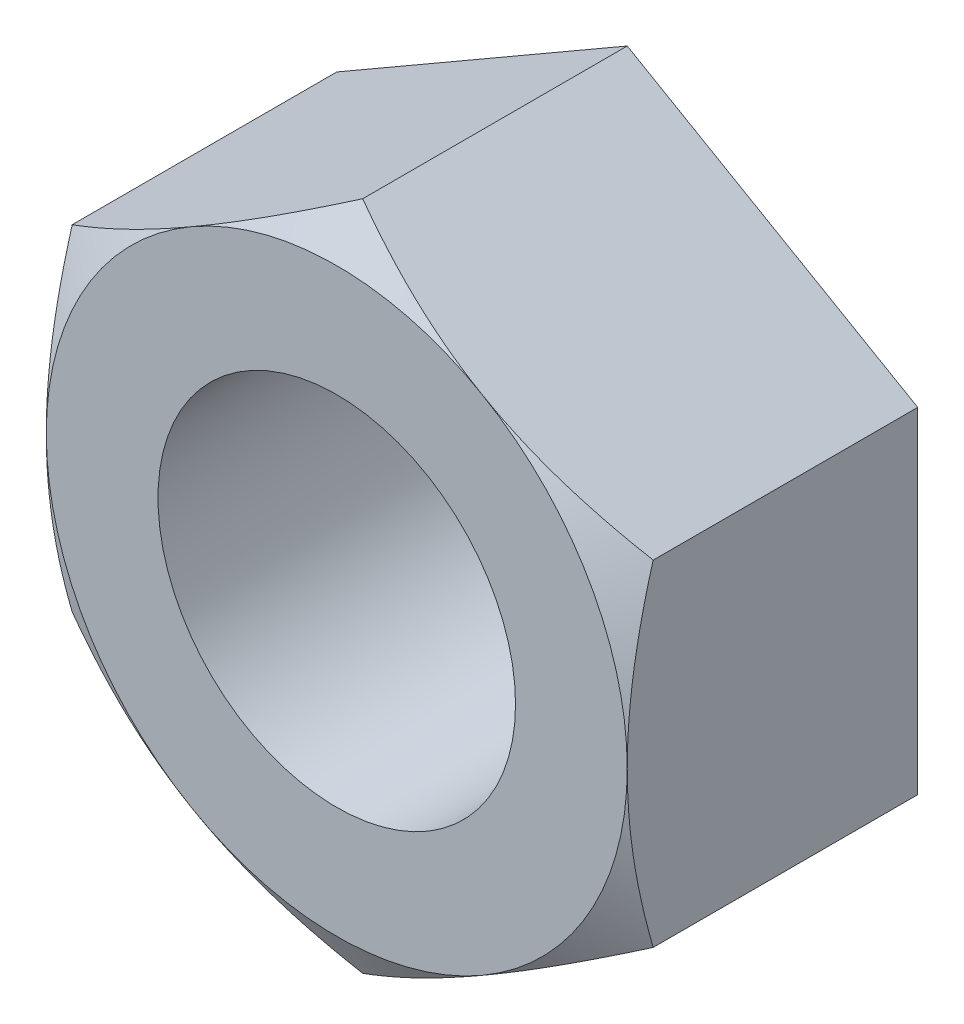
ISO-10303-21;
HEADER;
FILE_DESCRIPTION(('STEP AP214'),'2;1');
FILE_NAME('part.step','',(''),(''),'','','');
FILE_SCHEMA(('AUTOMOTIVE_DESIGN { 1 0 10303 214 1 1 1 1 }'));
ENDSEC;
DATA;
#1=APPLICATION_CONTEXT('core data for automotive mechanical design processes');
#2=APPLICATION_PROTOCOL_DEFINITION('international standard','automotive_design',2000,#1);
#3=PRODUCT_CONTEXT('',#1,'mechanical');
#4=PRODUCT('Part','Part','',(#3));
#5=PRODUCT_RELATED_PRODUCT_CATEGORY('part','',(#4));
#6=PRODUCT_DEFINITION_FORMATION('','',#4);
#7=PRODUCT_DEFINITION_CONTEXT('part definition',#1,'design');
#8=PRODUCT_DEFINITION('design','',#6,#7);
#9=PRODUCT_DEFINITION_SHAPE('','',#8);
#10=(LENGTH_UNIT() NAMED_UNIT(*) SI_UNIT(.MILLI.,.METRE.));
#11=(NAMED_UNIT(*) PLANE_ANGLE_UNIT() SI_UNIT($,.RADIAN.));
#12=(NAMED_UNIT(*) SI_UNIT($,.STERADIAN.) SOLID_ANGLE_UNIT());
#13=UNCERTAINTY_MEASURE_WITH_UNIT(LENGTH_MEASURE(1.E-05),#10,'distance_accuracy_value','');
#14=(GEOMETRIC_REPRESENTATION_CONTEXT(3) GLOBAL_UNCERTAINTY_ASSIGNED_CONTEXT((#13)) GLOBAL_UNIT_ASSIGNED_CONTEXT((#10,
#11,#12)) REPRESENTATION_CONTEXT('',''));
#15=CARTESIAN_POINT('',(0.,0.,0.));
#16=DIRECTION('',(0.,0.,1.));
#17=DIRECTION('',(1.,0.,0.));
#18=AXIS2_PLACEMENT_3D('',#15,#16,#17);
#19=CARTESIAN_POINT('',(-6.5,11.2583302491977,6.5));
#20=DIRECTION('',(0.,0.,1.));
#21=DIRECTION('',(1.,0.,0.));
#22=AXIS2_PLACEMENT_3D('',#19,#20,#21);
#23=PLANE('',#22);
#24=CARTESIAN_POINT('',(0.,0.,6.5));
#25=DIRECTION('',(0.,0.,1.));
#26=DIRECTION('',(1.,0.,0.));
#27=AXIS2_PLACEMENT_3D('',#24,#25,#26);
#28=CIRCLE('',#27,4.00000000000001);
#29=CARTESIAN_POINT('',(4.00000000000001,0.,6.5));
#30=VERTEX_POINT('',#29);
#31=EDGE_CURVE('E407',#30,#30,#28,.T.);
#32=ORIENTED_EDGE('',*,*,#31,.F.);
#33=EDGE_LOOP('',(#32));
#34=FACE_BOUND('',#33,.T.);
#35=CARTESIAN_POINT('',(0.,0.,6.50000000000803));
#36=DIRECTION('',(0.,0.,-1.));
#37=DIRECTION('',(-1.,0.,0.));
#38=AXIS2_PLACEMENT_3D('',#35,#36,#37);
#39=CIRCLE('',#38,6.50000000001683);
#40=CARTESIAN_POINT('',(-3.25000000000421,-5.62916512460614,6.50000000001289));
#41=VERTEX_POINT('',#40);
#42=CARTESIAN_POINT('',(-6.50000000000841,0.,6.50000000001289));
#43=VERTEX_POINT('',#42);
#44=EDGE_CURVE('E74',#41,#43,#39,.T.);
#45=ORIENTED_EDGE('',*,*,#44,.F.);
#46=CARTESIAN_POINT('',(0.,0.,6.50000000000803));
#47=DIRECTION('',(0.,0.,-1.));
#48=DIRECTION('',(-1.,0.,0.));
#49=AXIS2_PLACEMENT_3D('',#46,#47,#48);
#50=CIRCLE('',#49,6.50000000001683);
#51=CARTESIAN_POINT('',(3.25000000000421,-5.62916512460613,6.50000000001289));
#52=VERTEX_POINT('',#51);
#53=EDGE_CURVE('E356',#52,#41,#50,.T.);
#54=ORIENTED_EDGE('',*,*,#53,.F.);
#55=CARTESIAN_POINT('',(0.,0.,6.50000000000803));
#56=DIRECTION('',(0.,0.,-1.));
#57=DIRECTION('',(-1.,0.,0.));
#58=AXIS2_PLACEMENT_3D('',#55,#56,#57);
#59=CIRCLE('',#58,6.50000000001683);
#60=CARTESIAN_POINT('',(6.50000000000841,0.,6.50000000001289));
#61=VERTEX_POINT('',#60);
#62=EDGE_CURVE('E353',#61,#52,#59,.T.);
#63=ORIENTED_EDGE('',*,*,#62,.F.);
#64=CARTESIAN_POINT('',(0.,0.,6.50000000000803));
#65=DIRECTION('',(0.,0.,-1.));
#66=DIRECTION('',(-1.,0.,0.));
#67=AXIS2_PLACEMENT_3D('',#64,#65,#66);
#68=CIRCLE('',#67,6.50000000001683);
#69=CARTESIAN_POINT('',(3.25000000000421,5.62916512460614,6.50000000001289));
#70=VERTEX_POINT('',#69);
#71=EDGE_CURVE('E160',#70,#61,#68,.T.);
#72=ORIENTED_EDGE('',*,*,#71,.F.);
#73=CARTESIAN_POINT('',(0.,0.,6.50000000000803));
#74=DIRECTION('',(0.,0.,-1.));
#75=DIRECTION('',(-1.,0.,0.));
#76=AXIS2_PLACEMENT_3D('',#73,#74,#75);
#77=CIRCLE('',#76,6.50000000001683);
#78=CARTESIAN_POINT('',(-3.25000000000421,5.62916512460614,6.50000000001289));
#79=VERTEX_POINT('',#78);
#80=EDGE_CURVE('E55',#79,#70,#77,.T.);
#81=ORIENTED_EDGE('',*,*,#80,.F.);
#82=CARTESIAN_POINT('',(0.,0.,6.50000000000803));
#83=DIRECTION('',(0.,0.,-1.));
#84=DIRECTION('',(-1.,0.,0.));
#85=AXIS2_PLACEMENT_3D('',#82,#83,#84);
#86=CIRCLE('',#85,6.50000000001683);
#87=EDGE_CURVE('E80',#43,#79,#86,.T.);
#88=ORIENTED_EDGE('',*,*,#87,.F.);
#89=EDGE_LOOP('',(#45,#54,#63,#72,#81,#88));
#90=FACE_BOUND('',#89,.T.);
#91=ADVANCED_FACE('F37',(#34,#90),#23,.T.);
#92=CARTESIAN_POINT('',(0.,0.,5.91596007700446));
#93=DIRECTION('',(0.,0.,-1.));
#94=DIRECTION('',(-1.,0.,0.));
#95=AXIS2_PLACEMENT_3D('',#92,#93,#94);
#96=CONICAL_SURFACE('',#95,7.51158682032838,1.04719755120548);
#97=CARTESIAN_POINT('',(-3.25,5.62916512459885,6.50000000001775));
#98=CARTESIAN_POINT('',(-3.38794426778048,5.54952296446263,6.50002656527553));
#99=CARTESIAN_POINT('',(-3.52588189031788,5.46988464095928,6.49662027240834));
#100=CARTESIAN_POINT('',(-3.80148629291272,5.3107643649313,6.48313941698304));
#101=CARTESIAN_POINT('',(-3.93915312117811,5.2312823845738,6.47306617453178));
#102=CARTESIAN_POINT('',(-4.21332671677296,5.07298818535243,6.44651519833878));
#103=CARTESIAN_POINT('',(-4.34983584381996,4.994174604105,6.43006970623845));
#104=CARTESIAN_POINT('',(-4.62220372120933,4.83692293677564,6.39112797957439));
#105=CARTESIAN_POINT('',(-4.75806245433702,4.7584848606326,6.36863158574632));
#106=CARTESIAN_POINT('',(-5.16409991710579,4.52405902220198,6.2927610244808));
#107=CARTESIAN_POINT('',(-5.43309909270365,4.36875227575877,6.23096863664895));
#108=CARTESIAN_POINT('',(-5.96878416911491,4.05947435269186,6.08845958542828));
#109=CARTESIAN_POINT('',(-6.23545138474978,3.90551396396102,6.00764841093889));
#110=CARTESIAN_POINT('',(-6.50000000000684,3.75277674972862,5.9194434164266));
#111=B_SPLINE_CURVE_WITH_KNOTS('',3,(#97,#98,#99,#100,#101,#102,#103,#104,#105,#106,#107,#108,
#109,#110),.UNSPECIFIED.,.F.,.F.,(4,2,2,2,2,2,4),(0.,0.477804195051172,0.955513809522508,
1.43083727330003,1.90617324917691,2.85559935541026,3.80984701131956),.UNSPECIFIED.);
#112=CARTESIAN_POINT('',(-6.5,3.75277674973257,5.9194434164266));
#113=VERTEX_POINT('',#112);
#114=EDGE_CURVE('E177',#79,#113,#111,.T.);
#115=ORIENTED_EDGE('',*,*,#114,.T.);
#116=CARTESIAN_POINT('',(-6.5,3.75277674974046,5.9194434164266));
#117=CARTESIAN_POINT('',(-6.5,3.44730232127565,6.00764841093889));
#118=CARTESIAN_POINT('',(-6.5,3.13938154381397,6.08845958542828));
#119=CARTESIAN_POINT('',(-6.5,2.52082569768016,6.23096863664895));
#120=CARTESIAN_POINT('',(-6.5,2.21021220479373,6.2927610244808));
#121=CARTESIAN_POINT('',(-6.5,1.74136052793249,6.36863158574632));
#122=CARTESIAN_POINT('',(-6.5,1.58448437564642,6.39112797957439));
#123=CARTESIAN_POINT('',(-6.5,1.2699810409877,6.43006970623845));
#124=CARTESIAN_POINT('',(-6.5,1.11235387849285,6.44651519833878));
#125=CARTESIAN_POINT('',(-6.5,0.795765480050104,6.47306617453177));
#126=CARTESIAN_POINT('',(-6.5,0.636801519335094,6.48313941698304));
#127=CARTESIAN_POINT('',(-6.5,0.31856096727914,6.49662027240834));
#128=CARTESIAN_POINT('',(-6.5,0.15928432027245,6.50002656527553));
#129=CARTESIAN_POINT('',(-6.5,0.,6.50000000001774));
#130=B_SPLINE_CURVE_WITH_KNOTS('',3,(#116,#117,#118,#119,#120,#121,#122,#123,#124,#125,#126,
#127,#128,#129),.UNSPECIFIED.,.F.,.F.,(4,2,2,2,2,2,4),(0.,0.954247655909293,1.90367376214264,
2.37900973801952,2.85433320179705,3.33204281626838,3.80984701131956),.UNSPECIFIED.);
#131=EDGE_CURVE('E305',#113,#43,#130,.T.);
#132=ORIENTED_EDGE('',*,*,#131,.T.);
#133=ORIENTED_EDGE('',*,*,#87,.T.);
#134=EDGE_LOOP('',(#115,#132,#133));
#135=FACE_BOUND('',#134,.T.);
#136=ADVANCED_FACE('F310',(#135),#96,.T.);
#137=CARTESIAN_POINT('',(0.,0.,5.91596007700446));
#138=DIRECTION('',(0.,0.,-1.));
#139=DIRECTION('',(-1.,0.,0.));
#140=AXIS2_PLACEMENT_3D('',#137,#138,#139);
#141=CONICAL_SURFACE('',#140,7.51158682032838,1.04719755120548);
#142=ORIENTED_EDGE('',*,*,#44,.T.);
#143=CARTESIAN_POINT('',(-6.5,0.,6.50000000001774));
#144=CARTESIAN_POINT('',(-6.5,-0.15928432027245,6.50002656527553));
#145=CARTESIAN_POINT('',(-6.5,-0.31856096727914,6.49662027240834));
#146=CARTESIAN_POINT('',(-6.5,-0.636801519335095,6.48313941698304));
#147=CARTESIAN_POINT('',(-6.5,-0.795765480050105,6.47306617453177));
#148=CARTESIAN_POINT('',(-6.5,-1.11235387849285,6.44651519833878));
#149=CARTESIAN_POINT('',(-6.5,-1.2699810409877,6.43006970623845));
#150=CARTESIAN_POINT('',(-6.5,-1.58448437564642,6.39112797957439));
#151=CARTESIAN_POINT('',(-6.5,-1.74136052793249,6.36863158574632));
#152=CARTESIAN_POINT('',(-6.5,-2.21021220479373,6.2927610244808));
#153=CARTESIAN_POINT('',(-6.5,-2.52082569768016,6.23096863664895));
#154=CARTESIAN_POINT('',(-6.5,-3.13938154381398,6.08845958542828));
#155=CARTESIAN_POINT('',(-6.5,-3.44730232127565,6.00764841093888));
#156=CARTESIAN_POINT('',(-6.5,-3.75277674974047,5.9194434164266));
#157=B_SPLINE_CURVE_WITH_KNOTS('',3,(#143,#144,#145,#146,#147,#148,#149,#150,#151,#152,#153,
#154,#155,#156),.UNSPECIFIED.,.F.,.F.,(4,2,2,2,2,2,4),(0.,0.477804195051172,0.955513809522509,
1.43083727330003,1.90617324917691,2.85559935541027,3.80984701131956),.UNSPECIFIED.);
#158=CARTESIAN_POINT('',(-6.5,-3.75277674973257,5.9194434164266));
#159=VERTEX_POINT('',#158);
#160=EDGE_CURVE('E277',#43,#159,#157,.T.);
#161=ORIENTED_EDGE('',*,*,#160,.T.);
#162=CARTESIAN_POINT('',(-6.50000000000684,-3.75277674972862,5.9194434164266));
#163=CARTESIAN_POINT('',(-6.23545138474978,-3.90551396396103,6.00764841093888));
#164=CARTESIAN_POINT('',(-5.96878416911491,-4.05947435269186,6.08845958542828));
#165=CARTESIAN_POINT('',(-5.43309909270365,-4.36875227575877,6.23096863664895));
#166=CARTESIAN_POINT('',(-5.16409991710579,-4.52405902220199,6.2927610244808));
#167=CARTESIAN_POINT('',(-4.75806245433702,-4.75848486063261,6.36863158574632));
#168=CARTESIAN_POINT('',(-4.62220372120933,-4.83692293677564,6.39112797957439));
#169=CARTESIAN_POINT('',(-4.34983584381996,-4.994174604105,6.43006970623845));
#170=CARTESIAN_POINT('',(-4.21332671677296,-5.07298818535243,6.44651519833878));
#171=CARTESIAN_POINT('',(-3.93915312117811,-5.2312823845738,6.47306617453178));
#172=CARTESIAN_POINT('',(-3.80148629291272,-5.3107643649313,6.48313941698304));
#173=CARTESIAN_POINT('',(-3.52588189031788,-5.46988464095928,6.49662027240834));
#174=CARTESIAN_POINT('',(-3.38794426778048,-5.54952296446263,6.50002656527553));
#175=CARTESIAN_POINT('',(-3.25,-5.62916512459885,6.50000000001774));
#176=B_SPLINE_CURVE_WITH_KNOTS('',3,(#162,#163,#164,#165,#166,#167,#168,#169,#170,#171,#172,
#173,#174,#175),.UNSPECIFIED.,.F.,.F.,(4,2,2,2,2,2,4),(0.,0.954247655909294,1.90367376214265,
2.37900973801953,2.85433320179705,3.33204281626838,3.80984701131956),.UNSPECIFIED.);
#177=EDGE_CURVE('E336',#159,#41,#176,.T.);
#178=ORIENTED_EDGE('',*,*,#177,.T.);
#179=EDGE_LOOP('',(#142,#161,#178));
#180=FACE_BOUND('',#179,.T.);
#181=ADVANCED_FACE('F313',(#180),#141,.T.);
#182=CARTESIAN_POINT('',(0.,0.,5.91596007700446));
#183=DIRECTION('',(0.,0.,-1.));
#184=DIRECTION('',(-1.,0.,0.));
#185=AXIS2_PLACEMENT_3D('',#182,#183,#184);
#186=CONICAL_SURFACE('',#185,7.51158682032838,1.04719755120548);
#187=ORIENTED_EDGE('',*,*,#53,.T.);
#188=CARTESIAN_POINT('',(-3.25,-5.62916512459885,6.50000000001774));
#189=CARTESIAN_POINT('',(-3.11205573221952,-5.70880728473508,6.50002656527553));
#190=CARTESIAN_POINT('',(-2.97411810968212,-5.78844560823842,6.49662027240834));
#191=CARTESIAN_POINT('',(-2.69851370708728,-5.9475658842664,6.48313941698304));
#192=CARTESIAN_POINT('',(-2.56084687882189,-6.0270478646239,6.47306617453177));
#193=CARTESIAN_POINT('',(-2.28667328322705,-6.18534206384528,6.44651519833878));
#194=CARTESIAN_POINT('',(-2.15016415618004,-6.2641556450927,6.43006970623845));
#195=CARTESIAN_POINT('',(-1.87779627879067,-6.42140731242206,6.39112797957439));
#196=CARTESIAN_POINT('',(-1.74193754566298,-6.4998453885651,6.36863158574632));
#197=CARTESIAN_POINT('',(-1.33590008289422,-6.73427122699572,6.2927610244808));
#198=CARTESIAN_POINT('',(-1.06690090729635,-6.88957797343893,6.23096863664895));
#199=CARTESIAN_POINT('',(-0.531215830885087,-7.19885589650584,6.08845958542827));
#200=CARTESIAN_POINT('',(-0.264548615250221,-7.35281628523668,6.00764841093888));
#201=CARTESIAN_POINT('',(6.84003077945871E-12,-7.50555349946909,5.9194434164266));
#202=B_SPLINE_CURVE_WITH_KNOTS('',3,(#188,#189,#190,#191,#192,#193,#194,#195,#196,#197,#198,
#199,#200,#201),.UNSPECIFIED.,.F.,.F.,(4,2,2,2,2,2,4),(0.,0.477804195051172,0.955513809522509,
1.43083727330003,1.90617324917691,2.85559935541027,3.80984701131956),.UNSPECIFIED.);
#203=CARTESIAN_POINT('',(0.,-7.50555349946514,5.9194434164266));
#204=VERTEX_POINT('',#203);
#205=EDGE_CURVE('E241',#41,#204,#202,.T.);
#206=ORIENTED_EDGE('',*,*,#205,.T.);
#207=CARTESIAN_POINT('',(-6.84076456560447E-12,-7.50555349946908,5.9194434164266));
#208=CARTESIAN_POINT('',(0.26454861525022,-7.35281628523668,6.00764841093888));
#209=CARTESIAN_POINT('',(0.531215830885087,-7.19885589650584,6.08845958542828));
#210=CARTESIAN_POINT('',(1.06690090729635,-6.88957797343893,6.23096863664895));
#211=CARTESIAN_POINT('',(1.33590008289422,-6.73427122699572,6.2927610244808));
#212=CARTESIAN_POINT('',(1.74193754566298,-6.4998453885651,6.36863158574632));
#213=CARTESIAN_POINT('',(1.87779627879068,-6.42140731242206,6.39112797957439));
#214=CARTESIAN_POINT('',(2.15016415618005,-6.2641556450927,6.43006970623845));
#215=CARTESIAN_POINT('',(2.28667328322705,-6.18534206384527,6.44651519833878));
#216=CARTESIAN_POINT('',(2.56084687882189,-6.0270478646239,6.47306617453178));
#217=CARTESIAN_POINT('',(2.69851370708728,-5.9475658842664,6.48313941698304));
#218=CARTESIAN_POINT('',(2.97411810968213,-5.78844560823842,6.49662027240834));
#219=CARTESIAN_POINT('',(3.11205573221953,-5.70880728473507,6.50002656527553));
#220=CARTESIAN_POINT('',(3.25000000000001,-5.62916512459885,6.50000000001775));
#221=B_SPLINE_CURVE_WITH_KNOTS('',3,(#207,#208,#209,#210,#211,#212,#213,#214,#215,#216,#217,
#218,#219,#220),.UNSPECIFIED.,.F.,.F.,(4,2,2,2,2,2,4),(0.,0.954247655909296,1.90367376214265,
2.37900973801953,2.85433320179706,3.33204281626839,3.80984701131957),.UNSPECIFIED.);
#222=EDGE_CURVE('E276',#204,#52,#221,.T.);
#223=ORIENTED_EDGE('',*,*,#222,.T.);
#224=EDGE_LOOP('',(#187,#206,#223));
#225=FACE_BOUND('',#224,.T.);
#226=ADVANCED_FACE('F248',(#225),#186,.T.);
#227=CARTESIAN_POINT('',(0.,0.,5.91596007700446));
#228=DIRECTION('',(0.,0.,-1.));
#229=DIRECTION('',(-1.,0.,0.));
#230=AXIS2_PLACEMENT_3D('',#227,#228,#229);
#231=CONICAL_SURFACE('',#230,7.51158682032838,1.04719755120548);
#232=ORIENTED_EDGE('',*,*,#62,.T.);
#233=CARTESIAN_POINT('',(3.25,-5.62916512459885,6.50000000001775));
#234=CARTESIAN_POINT('',(3.38794426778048,-5.54952296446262,6.50002656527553));
#235=CARTESIAN_POINT('',(3.52588189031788,-5.46988464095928,6.49662027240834));
#236=CARTESIAN_POINT('',(3.80148629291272,-5.3107643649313,6.48313941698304));
#237=CARTESIAN_POINT('',(3.93915312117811,-5.2312823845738,6.47306617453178));
#238=CARTESIAN_POINT('',(4.21332671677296,-5.07298818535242,6.44651519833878));
#239=CARTESIAN_POINT('',(4.34983584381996,-4.994174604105,6.43006970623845));
#240=CARTESIAN_POINT('',(4.62220372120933,-4.83692293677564,6.39112797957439));
#241=CARTESIAN_POINT('',(4.75806245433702,-4.7584848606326,6.36863158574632));
#242=CARTESIAN_POINT('',(5.16409991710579,-4.52405902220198,6.2927610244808));
#243=CARTESIAN_POINT('',(5.43309909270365,-4.36875227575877,6.23096863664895));
#244=CARTESIAN_POINT('',(5.96878416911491,-4.05947435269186,6.08845958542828));
#245=CARTESIAN_POINT('',(6.23545138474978,-3.90551396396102,6.00764841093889));
#246=CARTESIAN_POINT('',(6.50000000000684,-3.75277674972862,5.9194434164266));
#247=B_SPLINE_CURVE_WITH_KNOTS('',3,(#233,#234,#235,#236,#237,#238,#239,#240,#241,#242,#243,
#244,#245,#246),.UNSPECIFIED.,.F.,.F.,(4,2,2,2,2,2,4),(0.,0.477804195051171,0.955513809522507,
1.43083727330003,1.90617324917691,2.85559935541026,3.80984701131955),.UNSPECIFIED.);
#248=CARTESIAN_POINT('',(6.5,-3.75277674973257,5.9194434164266));
#249=VERTEX_POINT('',#248);
#250=EDGE_CURVE('E226',#52,#249,#247,.T.);
#251=ORIENTED_EDGE('',*,*,#250,.T.);
#252=CARTESIAN_POINT('',(6.5,-3.75277674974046,5.9194434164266));
#253=CARTESIAN_POINT('',(6.5,-3.44730232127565,6.00764841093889));
#254=CARTESIAN_POINT('',(6.5,-3.13938154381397,6.08845958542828));
#255=CARTESIAN_POINT('',(6.5,-2.52082569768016,6.23096863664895));
#256=CARTESIAN_POINT('',(6.5,-2.21021220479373,6.2927610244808));
#257=CARTESIAN_POINT('',(6.5,-1.74136052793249,6.36863158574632));
#258=CARTESIAN_POINT('',(6.5,-1.58448437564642,6.39112797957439));
#259=CARTESIAN_POINT('',(6.5,-1.2699810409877,6.43006970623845));
#260=CARTESIAN_POINT('',(6.5,-1.11235387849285,6.44651519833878));
#261=CARTESIAN_POINT('',(6.5,-0.795765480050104,6.47306617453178));
#262=CARTESIAN_POINT('',(6.5,-0.636801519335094,6.48313941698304));
#263=CARTESIAN_POINT('',(6.5,-0.318560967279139,6.49662027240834));
#264=CARTESIAN_POINT('',(6.5,-0.159284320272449,6.50002656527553));
#265=CARTESIAN_POINT('',(6.5,0.,6.50000000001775));
#266=B_SPLINE_CURVE_WITH_KNOTS('',3,(#252,#253,#254,#255,#256,#257,#258,#259,#260,#261,#262,
#263,#264,#265),.UNSPECIFIED.,.F.,.F.,(4,2,2,2,2,2,4),(0.,0.954247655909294,1.90367376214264,
2.37900973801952,2.85433320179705,3.33204281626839,3.80984701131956),.UNSPECIFIED.);
#267=EDGE_CURVE('E240',#249,#61,#266,.T.);
#268=ORIENTED_EDGE('',*,*,#267,.T.);
#269=EDGE_LOOP('',(#232,#251,#268));
#270=FACE_BOUND('',#269,.T.);
#271=ADVANCED_FACE('F244',(#270),#231,.T.);
#272=CARTESIAN_POINT('',(0.,0.,5.91596007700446));
#273=DIRECTION('',(0.,0.,-1.));
#274=DIRECTION('',(-1.,0.,0.));
#275=AXIS2_PLACEMENT_3D('',#272,#273,#274);
#276=CONICAL_SURFACE('',#275,7.51158682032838,1.04719755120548);
#277=CARTESIAN_POINT('',(6.5,0.,6.50000000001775));
#278=CARTESIAN_POINT('',(6.5,0.159284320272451,6.50002656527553));
#279=CARTESIAN_POINT('',(6.5,0.31856096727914,6.49662027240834));
#280=CARTESIAN_POINT('',(6.5,0.636801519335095,6.48313941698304));
#281=CARTESIAN_POINT('',(6.5,0.795765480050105,6.47306617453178));
#282=CARTESIAN_POINT('',(6.5,1.11235387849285,6.44651519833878));
#283=CARTESIAN_POINT('',(6.5,1.2699810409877,6.43006970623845));
#284=CARTESIAN_POINT('',(6.5,1.58448437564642,6.39112797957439));
#285=CARTESIAN_POINT('',(6.5,1.7413605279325,6.36863158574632));
#286=CARTESIAN_POINT('',(6.5,2.21021220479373,6.2927610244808));
#287=CARTESIAN_POINT('',(6.5,2.52082569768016,6.23096863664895));
#288=CARTESIAN_POINT('',(6.5,3.13938154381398,6.08845958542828));
#289=CARTESIAN_POINT('',(6.5,3.44730232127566,6.00764841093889));
#290=CARTESIAN_POINT('',(6.5,3.75277674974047,5.9194434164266));
#291=B_SPLINE_CURVE_WITH_KNOTS('',3,(#277,#278,#279,#280,#281,#282,#283,#284,#285,#286,#287,
#288,#289,#290),.UNSPECIFIED.,.F.,.F.,(4,2,2,2,2,2,4),(0.,0.477804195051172,0.955513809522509,
1.43083727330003,1.90617324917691,2.85559935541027,3.80984701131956),.UNSPECIFIED.);
#292=CARTESIAN_POINT('',(6.5,3.75277674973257,5.9194434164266));
#293=VERTEX_POINT('',#292);
#294=EDGE_CURVE('E204',#61,#293,#291,.T.);
#295=ORIENTED_EDGE('',*,*,#294,.T.);
#296=CARTESIAN_POINT('',(6.50000000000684,3.75277674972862,5.9194434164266));
#297=CARTESIAN_POINT('',(6.23545138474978,3.90551396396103,6.00764841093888));
#298=CARTESIAN_POINT('',(5.96878416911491,4.05947435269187,6.08845958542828));
#299=CARTESIAN_POINT('',(5.43309909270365,4.36875227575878,6.23096863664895));
#300=CARTESIAN_POINT('',(5.16409991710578,4.52405902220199,6.2927610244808));
#301=CARTESIAN_POINT('',(4.75806245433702,4.75848486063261,6.36863158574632));
#302=CARTESIAN_POINT('',(4.62220372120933,4.83692293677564,6.39112797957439));
#303=CARTESIAN_POINT('',(4.34983584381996,4.994174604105,6.43006970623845));
#304=CARTESIAN_POINT('',(4.21332671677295,5.07298818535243,6.44651519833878));
#305=CARTESIAN_POINT('',(3.93915312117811,5.2312823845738,6.47306617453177));
#306=CARTESIAN_POINT('',(3.80148629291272,5.31076436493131,6.48313941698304));
#307=CARTESIAN_POINT('',(3.52588189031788,5.46988464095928,6.49662027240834));
#308=CARTESIAN_POINT('',(3.38794426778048,5.54952296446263,6.50002656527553));
#309=CARTESIAN_POINT('',(3.25,5.62916512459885,6.50000000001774));
#310=B_SPLINE_CURVE_WITH_KNOTS('',3,(#296,#297,#298,#299,#300,#301,#302,#303,#304,#305,#306,
#307,#308,#309),.UNSPECIFIED.,.F.,.F.,(4,2,2,2,2,2,4),(0.,0.954247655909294,1.90367376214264,
2.37900973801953,2.85433320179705,3.33204281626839,3.80984701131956),.UNSPECIFIED.);
#311=EDGE_CURVE('E47',#293,#70,#310,.T.);
#312=ORIENTED_EDGE('',*,*,#311,.T.);
#313=ORIENTED_EDGE('',*,*,#71,.T.);
#314=EDGE_LOOP('',(#295,#312,#313));
#315=FACE_BOUND('',#314,.T.);
#316=ADVANCED_FACE('F193',(#315),#276,.T.);
#317=CARTESIAN_POINT('',(0.,0.,5.91596007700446));
#318=DIRECTION('',(0.,0.,-1.));
#319=DIRECTION('',(-1.,0.,0.));
#320=AXIS2_PLACEMENT_3D('',#317,#318,#319);
#321=CONICAL_SURFACE('',#320,7.51158682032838,1.04719755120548);
#322=CARTESIAN_POINT('',(3.25,5.62916512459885,6.50000000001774));
#323=CARTESIAN_POINT('',(3.11205573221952,5.70880728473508,6.50002656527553));
#324=CARTESIAN_POINT('',(2.97411810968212,5.78844560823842,6.49662027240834));
#325=CARTESIAN_POINT('',(2.69851370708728,5.9475658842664,6.48313941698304));
#326=CARTESIAN_POINT('',(2.56084687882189,6.02704786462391,6.47306617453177));
#327=CARTESIAN_POINT('',(2.28667328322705,6.18534206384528,6.44651519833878));
#328=CARTESIAN_POINT('',(2.15016415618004,6.26415564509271,6.43006970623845));
#329=CARTESIAN_POINT('',(1.87779627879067,6.42140731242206,6.39112797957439));
#330=CARTESIAN_POINT('',(1.74193754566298,6.4998453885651,6.36863158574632));
#331=CARTESIAN_POINT('',(1.33590008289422,6.73427122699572,6.2927610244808));
#332=CARTESIAN_POINT('',(1.06690090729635,6.88957797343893,6.23096863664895));
#333=CARTESIAN_POINT('',(0.531215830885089,7.19885589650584,6.08845958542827));
#334=CARTESIAN_POINT('',(0.264548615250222,7.35281628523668,6.00764841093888));
#335=CARTESIAN_POINT('',(-6.83914730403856E-12,7.50555349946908,5.9194434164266));
#336=B_SPLINE_CURVE_WITH_KNOTS('',3,(#322,#323,#324,#325,#326,#327,#328,#329,#330,#331,#332,
#333,#334,#335),.UNSPECIFIED.,.F.,.F.,(4,2,2,2,2,2,4),(0.,0.477804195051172,0.955513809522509,
1.43083727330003,1.90617324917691,2.85559935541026,3.80984701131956),.UNSPECIFIED.);
#337=CARTESIAN_POINT('',(0.,7.50555349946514,5.9194434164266));
#338=VERTEX_POINT('',#337);
#339=EDGE_CURVE('E12',#70,#338,#336,.T.);
#340=ORIENTED_EDGE('',*,*,#339,.T.);
#341=CARTESIAN_POINT('',(6.84052348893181E-12,7.50555349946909,5.9194434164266));
#342=CARTESIAN_POINT('',(-0.26454861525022,7.35281628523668,6.00764841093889));
#343=CARTESIAN_POINT('',(-0.531215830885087,7.19885589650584,6.08845958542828));
#344=CARTESIAN_POINT('',(-1.06690090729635,6.88957797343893,6.23096863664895));
#345=CARTESIAN_POINT('',(-1.33590008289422,6.73427122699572,6.2927610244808));
#346=CARTESIAN_POINT('',(-1.74193754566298,6.4998453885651,6.36863158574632));
#347=CARTESIAN_POINT('',(-1.87779627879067,6.42140731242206,6.39112797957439));
#348=CARTESIAN_POINT('',(-2.15016415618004,6.2641556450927,6.43006970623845));
#349=CARTESIAN_POINT('',(-2.28667328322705,6.18534206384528,6.44651519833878));
#350=CARTESIAN_POINT('',(-2.56084687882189,6.0270478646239,6.47306617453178));
#351=CARTESIAN_POINT('',(-2.69851370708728,5.9475658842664,6.48313941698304));
#352=CARTESIAN_POINT('',(-2.97411810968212,5.78844560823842,6.49662027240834));
#353=CARTESIAN_POINT('',(-3.11205573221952,5.70880728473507,6.50002656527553));
#354=CARTESIAN_POINT('',(-3.25,5.62916512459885,6.50000000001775));
#355=B_SPLINE_CURVE_WITH_KNOTS('',3,(#341,#342,#343,#344,#345,#346,#347,#348,#349,#350,#351,
#352,#353,#354),.UNSPECIFIED.,.F.,.F.,(4,2,2,2,2,2,4),(0.,0.954247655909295,1.90367376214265,
2.37900973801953,2.85433320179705,3.33204281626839,3.80984701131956),.UNSPECIFIED.);
#356=EDGE_CURVE('E147',#338,#79,#355,.T.);
#357=ORIENTED_EDGE('',*,*,#356,.T.);
#358=ORIENTED_EDGE('',*,*,#80,.T.);
#359=EDGE_LOOP('',(#340,#357,#358));
#360=FACE_BOUND('',#359,.T.);
#361=ADVANCED_FACE('F189',(#360),#321,.T.);
#362=CARTESIAN_POINT('',(0.,7.50555349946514,6.5));
#363=DIRECTION('',(0.5,-0.866025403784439,0.));
#364=DIRECTION('',(0.866025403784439,0.5,0.));
#365=AXIS2_PLACEMENT_3D('',#362,#363,#364);
#366=PLANE('',#365);
#367=ORIENTED_EDGE('',*,*,#356,.F.);
#368=DIRECTION('',(0.,0.,1.));
#369=VECTOR('',#368,1.);
#370=CARTESIAN_POINT('',(0.,7.50555349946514,0.));
#371=LINE('',#370,#369);
#372=CARTESIAN_POINT('',(0.,7.50555349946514,0.));
#373=VERTEX_POINT('',#372);
#374=EDGE_CURVE('E144',#373,#338,#371,.T.);
#375=ORIENTED_EDGE('',*,*,#374,.F.);
#376=DIRECTION('',(0.866025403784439,0.5,0.));
#377=VECTOR('',#376,1.);
#378=CARTESIAN_POINT('',(0.,7.50555349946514,0.));
#379=LINE('',#378,#377);
#380=CARTESIAN_POINT('',(-6.5,3.75277674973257,0.));
#381=VERTEX_POINT('',#380);
#382=EDGE_CURVE('E133',#381,#373,#379,.T.);
#383=ORIENTED_EDGE('',*,*,#382,.F.);
#384=DIRECTION('',(0.,0.,1.));
#385=VECTOR('',#384,1.);
#386=CARTESIAN_POINT('',(-6.5,3.75277674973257,0.));
#387=LINE('',#386,#385);
#388=EDGE_CURVE('E150',#381,#113,#387,.T.);
#389=ORIENTED_EDGE('',*,*,#388,.T.);
#390=ORIENTED_EDGE('',*,*,#114,.F.);
#391=EDGE_LOOP('',(#367,#375,#383,#389,#390));
#392=FACE_BOUND('',#391,.T.);
#393=ADVANCED_FACE('F145',(#392),#366,.F.);
#394=CARTESIAN_POINT('',(-6.5,3.75277674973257,6.5));
#395=DIRECTION('',(1.,0.,0.));
#396=DIRECTION('',(0.,0.,-1.));
#397=AXIS2_PLACEMENT_3D('',#394,#395,#396);
#398=PLANE('',#397);
#399=ORIENTED_EDGE('',*,*,#131,.F.);
#400=ORIENTED_EDGE('',*,*,#388,.F.);
#401=DIRECTION('',(0.,1.,0.));
#402=VECTOR('',#401,1.);
#403=CARTESIAN_POINT('',(-6.5,3.75277674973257,0.));
#404=LINE('',#403,#402);
#405=CARTESIAN_POINT('',(-6.5,-3.75277674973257,0.));
#406=VERTEX_POINT('',#405);
#407=EDGE_CURVE('E139',#406,#381,#404,.T.);
#408=ORIENTED_EDGE('',*,*,#407,.F.);
#409=DIRECTION('',(0.,0.,1.));
#410=VECTOR('',#409,1.);
#411=CARTESIAN_POINT('',(-6.5,-3.75277674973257,0.));
#412=LINE('',#411,#410);
#413=EDGE_CURVE('E386',#406,#159,#412,.T.);
#414=ORIENTED_EDGE('',*,*,#413,.T.);
#415=ORIENTED_EDGE('',*,*,#160,.F.);
#416=EDGE_LOOP('',(#399,#400,#408,#414,#415));
#417=FACE_BOUND('',#416,.T.);
#418=ADVANCED_FACE('F325',(#417),#398,.F.);
#419=CARTESIAN_POINT('',(-6.5,-3.75277674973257,6.5));
#420=DIRECTION('',(0.5,0.866025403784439,0.));
#421=DIRECTION('',(-0.866025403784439,0.5,0.));
#422=AXIS2_PLACEMENT_3D('',#419,#420,#421);
#423=PLANE('',#422);
#424=ORIENTED_EDGE('',*,*,#177,.F.);
#425=ORIENTED_EDGE('',*,*,#413,.F.);
#426=DIRECTION('',(-0.866025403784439,0.5,0.));
#427=VECTOR('',#426,1.);
#428=CARTESIAN_POINT('',(-6.5,-3.75277674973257,0.));
#429=LINE('',#428,#427);
#430=CARTESIAN_POINT('',(0.,-7.50555349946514,0.));
#431=VERTEX_POINT('',#430);
#432=EDGE_CURVE('E126',#431,#406,#429,.T.);
#433=ORIENTED_EDGE('',*,*,#432,.F.);
#434=DIRECTION('',(0.,0.,1.));
#435=VECTOR('',#434,1.);
#436=CARTESIAN_POINT('',(0.,-7.50555349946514,0.));
#437=LINE('',#436,#435);
#438=EDGE_CURVE('E173',#431,#204,#437,.T.);
#439=ORIENTED_EDGE('',*,*,#438,.T.);
#440=ORIENTED_EDGE('',*,*,#205,.F.);
#441=EDGE_LOOP('',(#424,#425,#433,#439,#440));
#442=FACE_BOUND('',#441,.T.);
#443=ADVANCED_FACE('F265',(#442),#423,.F.);
#444=CARTESIAN_POINT('',(0.,-7.50555349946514,6.5));
#445=DIRECTION('',(-0.5,0.866025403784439,0.));
#446=DIRECTION('',(-0.866025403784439,-0.5,0.));
#447=AXIS2_PLACEMENT_3D('',#444,#445,#446);
#448=PLANE('',#447);
#449=ORIENTED_EDGE('',*,*,#222,.F.);
#450=ORIENTED_EDGE('',*,*,#438,.F.);
#451=DIRECTION('',(-0.866025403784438,-0.500000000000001,0.));
#452=VECTOR('',#451,1.);
#453=CARTESIAN_POINT('',(0.,-7.50555349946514,0.));
#454=LINE('',#453,#452);
#455=CARTESIAN_POINT('',(6.5,-3.75277674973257,0.));
#456=VERTEX_POINT('',#455);
#457=EDGE_CURVE('E400',#456,#431,#454,.T.);
#458=ORIENTED_EDGE('',*,*,#457,.F.);
#459=DIRECTION('',(0.,0.,1.));
#460=VECTOR('',#459,1.);
#461=CARTESIAN_POINT('',(6.5,-3.75277674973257,0.));
#462=LINE('',#461,#460);
#463=EDGE_CURVE('E118',#456,#249,#462,.T.);
#464=ORIENTED_EDGE('',*,*,#463,.T.);
#465=ORIENTED_EDGE('',*,*,#250,.F.);
#466=EDGE_LOOP('',(#449,#450,#458,#464,#465));
#467=FACE_BOUND('',#466,.T.);
#468=ADVANCED_FACE('F261',(#467),#448,.F.);
#469=CARTESIAN_POINT('',(6.5,-3.75277674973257,6.5));
#470=DIRECTION('',(-1.,0.,0.));
#471=DIRECTION('',(0.,-1.,0.));
#472=AXIS2_PLACEMENT_3D('',#469,#470,#471);
#473=PLANE('',#472);
#474=ORIENTED_EDGE('',*,*,#267,.F.);
#475=ORIENTED_EDGE('',*,*,#463,.F.);
#476=DIRECTION('',(0.,-1.,0.));
#477=VECTOR('',#476,1.);
#478=CARTESIAN_POINT('',(6.5,-3.75277674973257,0.));
#479=LINE('',#478,#477);
#480=CARTESIAN_POINT('',(6.5,3.75277674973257,0.));
#481=VERTEX_POINT('',#480);
#482=EDGE_CURVE('E95',#481,#456,#479,.T.);
#483=ORIENTED_EDGE('',*,*,#482,.F.);
#484=DIRECTION('',(0.,0.,1.));
#485=VECTOR('',#484,1.);
#486=CARTESIAN_POINT('',(6.5,3.75277674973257,0.));
#487=LINE('',#486,#485);
#488=EDGE_CURVE('E87',#481,#293,#487,.T.);
#489=ORIENTED_EDGE('',*,*,#488,.T.);
#490=ORIENTED_EDGE('',*,*,#294,.F.);
#491=EDGE_LOOP('',(#474,#475,#483,#489,#490));
#492=FACE_BOUND('',#491,.T.);
#493=ADVANCED_FACE('F213',(#492),#473,.F.);
#494=CARTESIAN_POINT('',(6.5,3.75277674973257,6.5));
#495=DIRECTION('',(-0.5,-0.866025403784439,0.));
#496=DIRECTION('',(0.866025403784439,-0.5,0.));
#497=AXIS2_PLACEMENT_3D('',#494,#495,#496);
#498=PLANE('',#497);
#499=ORIENTED_EDGE('',*,*,#311,.F.);
#500=ORIENTED_EDGE('',*,*,#488,.F.);
#501=DIRECTION('',(0.866025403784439,-0.5,0.));
#502=VECTOR('',#501,1.);
#503=CARTESIAN_POINT('',(6.5,3.75277674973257,0.));
#504=LINE('',#503,#502);
#505=EDGE_CURVE('E137',#373,#481,#504,.T.);
#506=ORIENTED_EDGE('',*,*,#505,.F.);
#507=ORIENTED_EDGE('',*,*,#374,.T.);
#508=ORIENTED_EDGE('',*,*,#339,.F.);
#509=EDGE_LOOP('',(#499,#500,#506,#507,#508));
#510=FACE_BOUND('',#509,.T.);
#511=ADVANCED_FACE('F152',(#510),#498,.F.);
#512=CARTESIAN_POINT('',(0.,0.,0.));
#513=DIRECTION('',(0.,0.,1.));
#514=DIRECTION('',(1.,0.,0.));
#515=AXIS2_PLACEMENT_3D('',#512,#513,#514);
#516=PLANE('',#515);
#517=CARTESIAN_POINT('',(0.,0.,0.));
#518=DIRECTION('',(0.,0.,1.));
#519=DIRECTION('',(1.,0.,0.));
#520=AXIS2_PLACEMENT_3D('',#517,#518,#519);
#521=CIRCLE('',#520,4.00000000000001);
#522=CARTESIAN_POINT('',(4.00000000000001,0.,0.));
#523=VERTEX_POINT('',#522);
#524=EDGE_CURVE('E404',#523,#523,#521,.T.);
#525=ORIENTED_EDGE('',*,*,#524,.T.);
#526=EDGE_LOOP('',(#525));
#527=FACE_BOUND('',#526,.T.);
#528=ORIENTED_EDGE('',*,*,#457,.T.);
#529=ORIENTED_EDGE('',*,*,#432,.T.);
#530=ORIENTED_EDGE('',*,*,#407,.T.);
#531=ORIENTED_EDGE('',*,*,#382,.T.);
#532=ORIENTED_EDGE('',*,*,#505,.T.);
#533=ORIENTED_EDGE('',*,*,#482,.T.);
#534=EDGE_LOOP('',(#528,#529,#530,#531,#532,#533));
#535=FACE_BOUND('',#534,.T.);
#536=ADVANCED_FACE('F135',(#527,#535),#516,.F.);
#537=CARTESIAN_POINT('',(0.,0.,6.5));
#538=DIRECTION('',(0.,0.,1.));
#539=DIRECTION('',(1.,0.,0.));
#540=AXIS2_PLACEMENT_3D('',#537,#538,#539);
#541=CYLINDRICAL_SURFACE('',#540,4.00000000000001);
#542=ORIENTED_EDGE('',*,*,#31,.T.);
#543=EDGE_LOOP('',(#542));
#544=FACE_BOUND('',#543,.T.);
#545=ORIENTED_EDGE('',*,*,#524,.F.);
#546=EDGE_LOOP('',(#545));
#547=FACE_BOUND('',#546,.T.);
#548=ADVANCED_FACE('F411',(#544,#547),#541,.F.);
#549=CLOSED_SHELL('',(#91,#136,#181,#226,#271,#316,#361,#393,#418,#443,#468,#493,#511,#536,#548));
#550=MANIFOLD_SOLID_BREP('B2',#549);
#551=ADVANCED_BREP_SHAPE_REPRESENTATION('',(#18,#550),#14);
#552=SHAPE_DEFINITION_REPRESENTATION(#9,#551);
ENDSEC;
END-ISO-10303-21;
